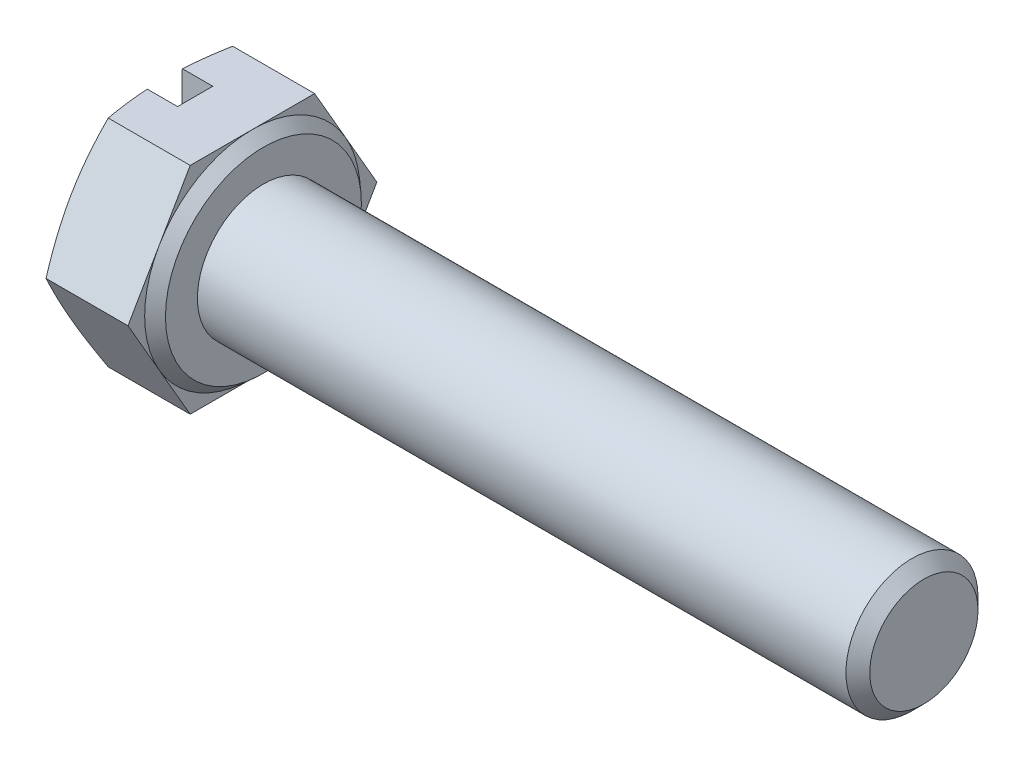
from build123d import *

# Parameters (mm, degrees)
BASEHEAD_DEPTH  = 4
SKETCH3_R       = 3
BASEBODY_DEPTH  = 30
CHAMFER1_SIZE   = 0.5415
SLOT_DEPTH      = 36.30097815
SLOT_DEPTH_BACK = 36.30097815
SKETCH5_W       = 1.4
SKETCH5_H       = 1.6


with BuildPart() as part:
    # Sketch-BaseHead → BaseHead (new body)
    with BuildSketch(Plane(origin=(0, 0, 0), x_dir=(0, 0, -1), z_dir=(1, 0, 0))):
        Polygon((2.826129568, -4.895), (5.652259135, 0), (2.826129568, 4.895), (-2.826129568, 4.895), (-5.652259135, 0), (-2.826129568, -4.895), align=None)
    extrude(amount=BASEHEAD_DEPTH)

    # Sketch1 → Revolve1 (revolve)
    with BuildSketch(Plane.XY, mode=Mode.PRIVATE) as revolve1_sk:
        Polygon((4, 0), (4.5, 0), (4.5, -4.45), (4, -4.895), align=None)
    revolve(revolve1_sk.sketch.rotate(Axis((-4.001564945, 0, 0), (1, 0, 0)), 270), axis=Axis((-4.001564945, 0, 0), (1, 0, 0)))

    # Sketch3 → BaseBody (add)
    with BuildSketch(Plane(origin=(4.5, 0, 0), x_dir=(0, 0, -1), z_dir=(1, 0, 0))):
        Circle(SKETCH3_R)
    extrude(amount=BASEBODY_DEPTH)

    # Chamfer1
    chamfer1_edges = [part.edges().sort_by_distance(p)[0] for p in [
        (34.5, 0, 3),
    ]]
    chamfer(chamfer1_edges, length=CHAMFER1_SIZE)

    # Sketch4 → HeadChamfer (revolve, cut)
    with BuildSketch(Plane(origin=(-0.264637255, 0, 5.916896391), x_dir=(0, 0, -1), z_dir=(0, 1, 0))):
        Polygon((11.569155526, -0.264637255), (10.811896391, -0.264637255), (11.569155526, -0.54025704), align=None)
    revolve(axis=Axis((-4.001564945, 0, 0), (1, 0, 0)), mode=Mode.SUBTRACT)

    # Sketch5 → Slot (cut, two sides: drawn at the far end of the back side and taken through both)
    with BuildSketch(Plane(origin=(0, 0, 0), x_dir=(1, 0, 0), z_dir=(0, 1, 0)).offset(-SLOT_DEPTH_BACK)):
        with Locations((0.7, 0)):
            Rectangle(SKETCH5_W, SKETCH5_H)
    extrude(amount=SLOT_DEPTH + SLOT_DEPTH_BACK, mode=Mode.SUBTRACT)


solid = part.part
